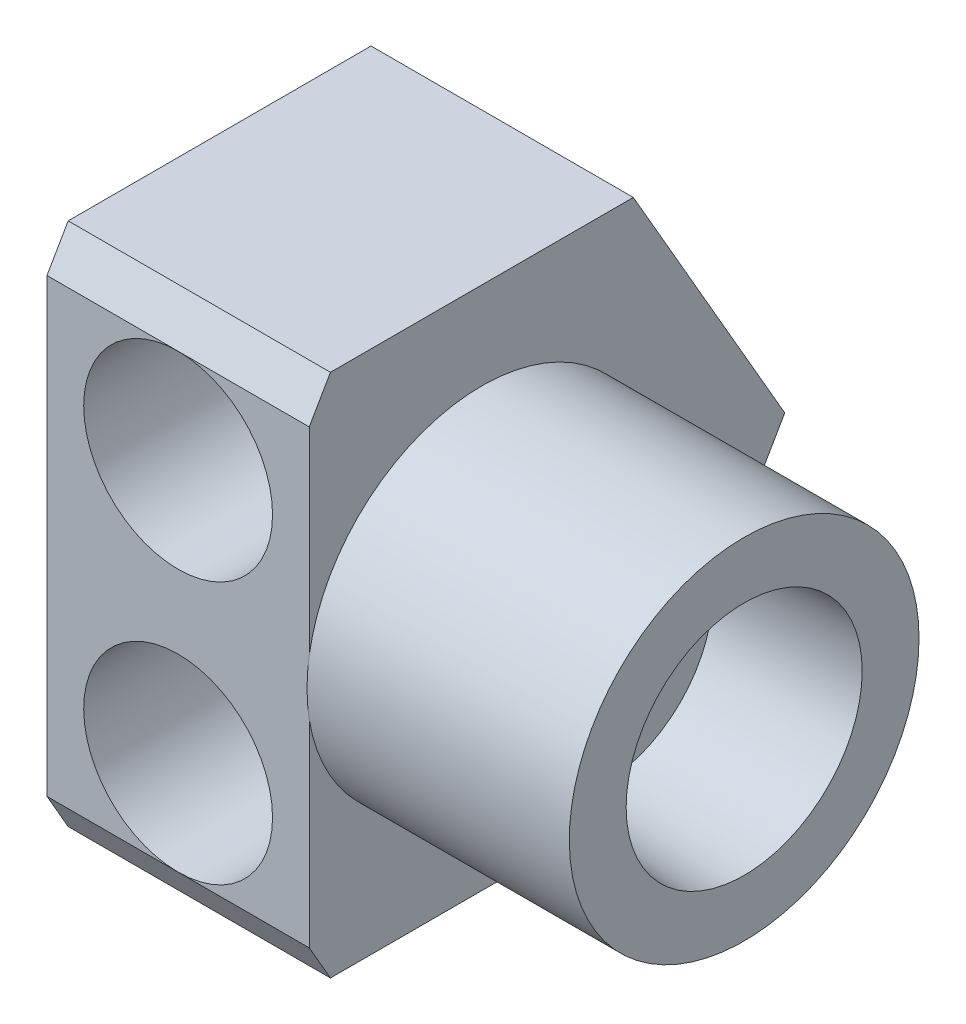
ISO-10303-21;
HEADER;
FILE_DESCRIPTION(('STEP AP214'),'2;1');
FILE_NAME('part.step','',(''),(''),'','','');
FILE_SCHEMA(('AUTOMOTIVE_DESIGN { 1 0 10303 214 1 1 1 1 }'));
ENDSEC;
DATA;
#1=APPLICATION_CONTEXT('core data for automotive mechanical design processes');
#2=APPLICATION_PROTOCOL_DEFINITION('international standard','automotive_design',2000,#1);
#3=PRODUCT_CONTEXT('',#1,'mechanical');
#4=PRODUCT('Part','Part','',(#3));
#5=PRODUCT_RELATED_PRODUCT_CATEGORY('part','',(#4));
#6=PRODUCT_DEFINITION_FORMATION('','',#4);
#7=PRODUCT_DEFINITION_CONTEXT('part definition',#1,'design');
#8=PRODUCT_DEFINITION('design','',#6,#7);
#9=PRODUCT_DEFINITION_SHAPE('','',#8);
#10=(LENGTH_UNIT() NAMED_UNIT(*) SI_UNIT(.MILLI.,.METRE.));
#11=(NAMED_UNIT(*) PLANE_ANGLE_UNIT() SI_UNIT($,.RADIAN.));
#12=(NAMED_UNIT(*) SI_UNIT($,.STERADIAN.) SOLID_ANGLE_UNIT());
#13=UNCERTAINTY_MEASURE_WITH_UNIT(LENGTH_MEASURE(1.E-05),#10,'distance_accuracy_value','');
#14=(GEOMETRIC_REPRESENTATION_CONTEXT(3) GLOBAL_UNCERTAINTY_ASSIGNED_CONTEXT((#13)) GLOBAL_UNIT_ASSIGNED_CONTEXT((#10,
#11,#12)) REPRESENTATION_CONTEXT('',''));
#15=CARTESIAN_POINT('',(0.,0.,0.));
#16=DIRECTION('',(0.,0.,1.));
#17=DIRECTION('',(1.,0.,0.));
#18=AXIS2_PLACEMENT_3D('',#15,#16,#17);
#19=CARTESIAN_POINT('',(9.525,-9.525,-5.01171935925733));
#20=DIRECTION('',(0.,0.,1.));
#21=DIRECTION('',(0.,-1.,0.));
#22=AXIS2_PLACEMENT_3D('',#19,#20,#21);
#23=CONICAL_SURFACE('',#22,5.83094592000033,1.0274700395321);
#24=CARTESIAN_POINT('',(9.525,-9.5250000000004,-8.53337832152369));
#25=VERTEX_POINT('',#24);
#26=VERTEX_LOOP('',#25);
#27=FACE_BOUND('',#26,.T.);
#28=CARTESIAN_POINT('',(9.525,-9.525,-5.01171935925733));
#29=DIRECTION('',(0.,0.,-1.));
#30=DIRECTION('',(0.,1.,0.));
#31=AXIS2_PLACEMENT_3D('',#28,#29,#30);
#32=CIRCLE('',#31,5.83094592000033);
#33=CARTESIAN_POINT('',(9.525,-15.3559459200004,-5.01171935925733));
#34=VERTEX_POINT('',#33);
#35=EDGE_CURVE('E11',#34,#34,#32,.T.);
#36=ORIENTED_EDGE('',*,*,#35,.F.);
#37=EDGE_LOOP('',(#36));
#38=FACE_BOUND('',#37,.T.);
#39=ADVANCED_FACE('F16',(#27,#38),#23,.F.);
#40=CARTESIAN_POINT('',(9.525,9.525,-5.01171935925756));
#41=DIRECTION('',(0.,0.,1.));
#42=DIRECTION('',(0.,-1.,0.));
#43=AXIS2_PLACEMENT_3D('',#40,#41,#42);
#44=CONICAL_SURFACE('',#43,5.83094592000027,1.02747003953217);
#45=CARTESIAN_POINT('',(9.525,9.525,-8.53337832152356));
#46=VERTEX_POINT('',#45);
#47=VERTEX_LOOP('',#46);
#48=FACE_BOUND('',#47,.T.);
#49=CARTESIAN_POINT('',(9.525,9.525,-5.01171935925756));
#50=DIRECTION('',(0.,0.,-1.));
#51=DIRECTION('',(0.,1.,0.));
#52=AXIS2_PLACEMENT_3D('',#49,#50,#51);
#53=CIRCLE('',#52,5.83094592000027);
#54=CARTESIAN_POINT('',(9.525,3.69405407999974,-5.01171935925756));
#55=VERTEX_POINT('',#54);
#56=EDGE_CURVE('E27',#55,#55,#53,.T.);
#57=ORIENTED_EDGE('',*,*,#56,.F.);
#58=EDGE_LOOP('',(#57));
#59=FACE_BOUND('',#58,.T.);
#60=ADVANCED_FACE('F284',(#48,#59),#44,.F.);
#61=CARTESIAN_POINT('',(9.525,-9.525,20.8181197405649));
#62=DIRECTION('',(0.,0.,1.));
#63=DIRECTION('',(0.,1.,0.));
#64=AXIS2_PLACEMENT_3D('',#61,#62,#63);
#65=CYLINDRICAL_SURFACE('',#64,5.83094592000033);
#66=CARTESIAN_POINT('',(7.62798098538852,-4.01126721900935,-2.56732186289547));
#67=CARTESIAN_POINT('',(7.69828168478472,-3.98708001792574,-2.60511273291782));
#68=CARTESIAN_POINT('',(7.77009788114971,-3.96387525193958,-2.64019821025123));
#69=CARTESIAN_POINT('',(7.91668903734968,-3.91972340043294,-2.70531367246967));
#70=CARTESIAN_POINT('',(7.99146402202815,-3.89877591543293,-2.73534333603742));
#71=CARTESIAN_POINT('',(8.10582340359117,-3.86925795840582,-2.77678532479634));
#72=CARTESIAN_POINT('',(8.14430967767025,-3.85973579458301,-2.78999813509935));
#73=CARTESIAN_POINT('',(8.2025890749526,-3.84595446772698,-2.8089324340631));
#74=CARTESIAN_POINT('',(8.22210722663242,-3.84144434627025,-2.81509633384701));
#75=CARTESIAN_POINT('',(8.26132721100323,-3.83259580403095,-2.82713130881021));
#76=CARTESIAN_POINT('',(8.28104366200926,-3.82825426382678,-2.83300658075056));
#77=CARTESIAN_POINT('',(8.37991257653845,-3.80702399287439,-2.8616055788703));
#78=CARTESIAN_POINT('',(8.45959771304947,-3.79163469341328,-2.88191308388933));
#79=CARTESIAN_POINT('',(8.62009959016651,-3.76412202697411,-2.91775633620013));
#80=CARTESIAN_POINT('',(8.7009163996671,-3.75199847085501,-2.93329149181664));
#81=CARTESIAN_POINT('',(8.8636545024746,-3.73109953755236,-2.95982900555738));
#82=CARTESIAN_POINT('',(8.94557581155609,-3.72232398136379,-2.97083112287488));
#83=CARTESIAN_POINT('',(9.11051558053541,-3.7082153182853,-2.98842308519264));
#84=CARTESIAN_POINT('',(9.1935340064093,-3.70288202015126,-2.99501300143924));
#85=CARTESIAN_POINT('',(9.29800071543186,-3.69843677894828,-3.00049556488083));
#86=CARTESIAN_POINT('',(9.31892879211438,-3.69765885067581,-3.00145404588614));
#87=CARTESIAN_POINT('',(9.36085482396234,-3.69632720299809,-3.00309383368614));
#88=CARTESIAN_POINT('',(9.38186951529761,-3.6957732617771,-3.00377541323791));
#89=CARTESIAN_POINT('',(9.44481134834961,-3.69445443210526,-3.0053975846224));
#90=CARTESIAN_POINT('',(9.48668205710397,-3.69403029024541,-3.00591857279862));
#91=CARTESIAN_POINT('',(9.61202671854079,-3.69410474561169,-3.00582707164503));
#92=CARTESIAN_POINT('',(9.69523362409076,-3.69594956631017,-3.0035638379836));
#93=CARTESIAN_POINT('',(9.86094620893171,-3.70314904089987,-2.99468297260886));
#94=CARTESIAN_POINT('',(9.94345186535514,-3.70850382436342,-2.98806521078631));
#95=CARTESIAN_POINT('',(10.107759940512,-3.72266249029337,-2.97040709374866));
#96=CARTESIAN_POINT('',(10.1895623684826,-3.73146648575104,-2.95936692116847));
#97=CARTESIAN_POINT('',(10.3524490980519,-3.75247873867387,-2.93267762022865));
#98=CARTESIAN_POINT('',(10.4335334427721,-3.76468710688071,-2.91702901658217));
#99=CARTESIAN_POINT('',(10.554599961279,-3.78552867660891,-2.88986317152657));
#100=CARTESIAN_POINT('',(10.5949195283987,-3.79291008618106,-2.88017432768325));
#101=CARTESIAN_POINT('',(10.6747292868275,-3.8083834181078,-2.85968299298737));
#102=CARTESIAN_POINT('',(10.7142880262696,-3.81648587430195,-2.84886697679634));
#103=CARTESIAN_POINT('',(10.8319316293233,-3.84184094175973,-2.81468814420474));
#104=CARTESIAN_POINT('',(10.908985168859,-3.86014119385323,-2.78959755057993));
#105=CARTESIAN_POINT('',(11.0603395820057,-3.8992758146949,-2.73462843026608));
#106=CARTESIAN_POINT('',(11.1346403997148,-3.92011055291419,-2.7047500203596));
#107=CARTESIAN_POINT('',(11.2804468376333,-3.96405274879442,-2.63992901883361));
#108=CARTESIAN_POINT('',(11.3519525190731,-3.98716059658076,-2.60498683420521));
#109=CARTESIAN_POINT('',(11.4220190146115,-4.01126721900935,-2.56732186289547));
#110=B_SPLINE_CURVE_WITH_KNOTS('',3,(#66,#67,#68,#69,#70,#71,#72,#73,#74,#75,#76,#77,#78,#79,
#80,#81,#82,#83,#84,#85,#86,#87,#88,#89,#90,#91,#92,#93,#94,#95,#96,#97,#98,#99,#100,#101,#102,
#103,#104,#105,#106,#107,#108,#109),.UNSPECIFIED.,.F.,.F.,(4,2,2,2,2,2,2,2,2,2,2,2,2,2,2,2,2,2,
2,2,2,4),(0.,0.0625,0.125,0.15625,0.171875,0.1875,0.25,0.3125,0.375,0.4375,0.453125,0.46875,0.5,
0.5625,0.625,0.6875,0.75,0.78125,0.8125,0.875,0.9375,1.),.UNSPECIFIED.);
#111=CARTESIAN_POINT('',(7.62798098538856,-4.01126721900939,-2.5673218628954));
#112=VERTEX_POINT('',#111);
#113=CARTESIAN_POINT('',(11.4220190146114,-4.01126721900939,-2.5673218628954));
#114=VERTEX_POINT('',#113);
#115=EDGE_CURVE('E409',#112,#114,#110,.T.);
#116=ORIENTED_EDGE('',*,*,#115,.F.);
#117=CARTESIAN_POINT('',(9.525,-9.525,-2.5673218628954));
#118=DIRECTION('',(0.,0.,-1.));
#119=DIRECTION('',(0.,1.,0.));
#120=AXIS2_PLACEMENT_3D('',#117,#118,#119);
#121=CIRCLE('',#120,5.83094592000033);
#122=EDGE_CURVE('E415',#114,#112,#121,.T.);
#123=ORIENTED_EDGE('',*,*,#122,.F.);
#124=EDGE_LOOP('',(#116,#123));
#125=FACE_BOUND('',#124,.T.);
#126=ORIENTED_EDGE('',*,*,#35,.T.);
#127=EDGE_LOOP('',(#126));
#128=FACE_BOUND('',#127,.T.);
#129=ADVANCED_FACE('F289',(#125,#128),#65,.F.);
#130=CARTESIAN_POINT('',(9.525,9.525,20.8181197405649));
#131=DIRECTION('',(0.,0.,1.));
#132=DIRECTION('',(0.,1.,0.));
#133=AXIS2_PLACEMENT_3D('',#130,#131,#132);
#134=CYLINDRICAL_SURFACE('',#133,5.83094592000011);
#135=CARTESIAN_POINT('',(11.4220190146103,4.01126721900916,-2.56732186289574));
#136=CARTESIAN_POINT('',(11.3517183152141,3.98708001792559,-2.60511273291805));
#137=CARTESIAN_POINT('',(11.2799021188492,3.96387525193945,-2.64019821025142));
#138=CARTESIAN_POINT('',(11.1333109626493,3.91972340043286,-2.70531367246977));
#139=CARTESIAN_POINT('',(11.0585359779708,3.89877591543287,-2.73534333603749));
#140=CARTESIAN_POINT('',(10.9441765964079,3.86925795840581,-2.77678532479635));
#141=CARTESIAN_POINT('',(10.9056903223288,3.85973579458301,-2.78999813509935));
#142=CARTESIAN_POINT('',(10.8474109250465,3.845954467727,-2.80893243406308));
#143=CARTESIAN_POINT('',(10.8278927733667,3.84144434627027,-2.81509633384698));
#144=CARTESIAN_POINT('',(10.7886727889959,3.83259580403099,-2.82713130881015));
#145=CARTESIAN_POINT('',(10.7689563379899,3.82825426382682,-2.83300658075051));
#146=CARTESIAN_POINT('',(10.6700874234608,3.80702399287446,-2.86160557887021));
#147=CARTESIAN_POINT('',(10.5904022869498,3.79163469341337,-2.88191308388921));
#148=CARTESIAN_POINT('',(10.4299004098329,3.76412202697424,-2.91775633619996));
#149=CARTESIAN_POINT('',(10.3490836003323,3.75199847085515,-2.93329149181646));
#150=CARTESIAN_POINT('',(10.1863454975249,3.73109953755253,-2.95982900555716));
#151=CARTESIAN_POINT('',(10.1044241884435,3.72232398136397,-2.97083112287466));
#152=CARTESIAN_POINT('',(9.9394844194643,3.7082153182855,-2.98842308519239));
#153=CARTESIAN_POINT('',(9.85646599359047,3.70288202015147,-2.99501300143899));
#154=CARTESIAN_POINT('',(9.75199928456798,3.6984367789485,-3.00049556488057));
#155=CARTESIAN_POINT('',(9.73107120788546,3.69765885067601,-3.00145404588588));
#156=CARTESIAN_POINT('',(9.68914517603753,3.69632720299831,-3.00309383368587));
#157=CARTESIAN_POINT('',(9.66813048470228,3.69577326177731,-3.00377541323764));
#158=CARTESIAN_POINT('',(9.60518865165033,3.69445443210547,-3.00539758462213));
#159=CARTESIAN_POINT('',(9.56331794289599,3.69403029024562,-3.00591857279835));
#160=CARTESIAN_POINT('',(9.43797328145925,3.6941047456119,-3.00582707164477));
#161=CARTESIAN_POINT('',(9.35476637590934,3.69594956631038,-3.00356383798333));
#162=CARTESIAN_POINT('',(9.1890537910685,3.70314904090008,-2.9946829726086));
#163=CARTESIAN_POINT('',(9.10654813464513,3.70850382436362,-2.98806521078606));
#164=CARTESIAN_POINT('',(8.9422400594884,3.72266249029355,-2.97040709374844));
#165=CARTESIAN_POINT('',(8.86043763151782,3.73146648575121,-2.95936692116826));
#166=CARTESIAN_POINT('',(8.69755090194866,3.75247873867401,-2.93267762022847));
#167=CARTESIAN_POINT('',(8.61646655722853,3.76468710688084,-2.917029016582));
#168=CARTESIAN_POINT('',(8.49540003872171,3.78552867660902,-2.88986317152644));
#169=CARTESIAN_POINT('',(8.45508047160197,3.79291008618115,-2.88017432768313));
#170=CARTESIAN_POINT('',(8.3752707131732,3.80838341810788,-2.85968299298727));
#171=CARTESIAN_POINT('',(8.33571197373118,3.81648587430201,-2.84886697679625));
#172=CARTESIAN_POINT('',(8.21806837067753,3.84184094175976,-2.8146881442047));
#173=CARTESIAN_POINT('',(8.1410148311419,3.86014119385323,-2.78959755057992));
#174=CARTESIAN_POINT('',(7.98966041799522,3.89927581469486,-2.73462843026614));
#175=CARTESIAN_POINT('',(7.91535960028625,3.92011055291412,-2.70475002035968));
#176=CARTESIAN_POINT('',(7.76955316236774,3.96405274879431,-2.63992901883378));
#177=CARTESIAN_POINT('',(7.69804748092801,3.98716059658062,-2.60498683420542));
#178=CARTESIAN_POINT('',(7.62798098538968,4.01126721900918,-2.56732186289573));
#179=B_SPLINE_CURVE_WITH_KNOTS('',3,(#135,#136,#137,#138,#139,#140,#141,#142,#143,#144,#145,
#146,#147,#148,#149,#150,#151,#152,#153,#154,#155,#156,#157,#158,#159,#160,#161,#162,#163,#164,
#165,#166,#167,#168,#169,#170,#171,#172,#173,#174,#175,#176,#177,#178),.UNSPECIFIED.,.F.,.F.,(4,
2,2,2,2,2,2,2,2,2,2,2,2,2,2,2,2,2,2,2,2,4),(0.,0.0625,0.125,0.15625,0.171875,0.1875,0.25,0.3125,
0.375000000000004,0.4375,0.453125,0.46875,0.5,0.5625,0.625,0.6875,0.75,0.78125,0.8125,0.875,
0.9375,1.),.UNSPECIFIED.);
#180=CARTESIAN_POINT('',(11.4220190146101,4.01126721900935,-2.56732186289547));
#181=VERTEX_POINT('',#180);
#182=CARTESIAN_POINT('',(7.62798098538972,4.01126721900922,-2.56732186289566));
#183=VERTEX_POINT('',#182);
#184=EDGE_CURVE('E421',#181,#183,#179,.T.);
#185=ORIENTED_EDGE('',*,*,#184,.F.);
#186=CARTESIAN_POINT('',(9.525,9.525,-2.56732186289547));
#187=DIRECTION('',(0.,0.,-1.));
#188=DIRECTION('',(0.,1.,0.));
#189=AXIS2_PLACEMENT_3D('',#186,#187,#188);
#190=CIRCLE('',#189,5.83094591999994);
#191=EDGE_CURVE('E428',#183,#181,#190,.T.);
#192=ORIENTED_EDGE('',*,*,#191,.F.);
#193=EDGE_LOOP('',(#185,#192));
#194=FACE_BOUND('',#193,.T.);
#195=ORIENTED_EDGE('',*,*,#56,.T.);
#196=EDGE_LOOP('',(#195));
#197=FACE_BOUND('',#196,.T.);
#198=ADVANCED_FACE('F296',(#194,#197),#134,.F.);
#199=CARTESIAN_POINT('',(27.7876,-8.03205001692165,0.));
#200=DIRECTION('',(-1.,0.,0.));
#201=DIRECTION('',(0.,0.,1.));
#202=AXIS2_PLACEMENT_3D('',#199,#200,#201);
#203=PLANE('',#202);
#204=CARTESIAN_POINT('',(27.7876,0.,0.));
#205=DIRECTION('',(-1.,0.,0.));
#206=DIRECTION('',(0.,0.,1.));
#207=AXIS2_PLACEMENT_3D('',#204,#205,#206);
#208=CIRCLE('',#207,8.03205001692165);
#209=CARTESIAN_POINT('',(27.7876,0.,-8.03205001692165));
#210=VERTEX_POINT('',#209);
#211=EDGE_CURVE('E433',#210,#210,#208,.T.);
#212=ORIENTED_EDGE('',*,*,#211,.F.);
#213=EDGE_LOOP('',(#212));
#214=FACE_BOUND('',#213,.T.);
#215=CARTESIAN_POINT('',(27.7876,0.,0.));
#216=DIRECTION('',(-1.,0.,0.));
#217=DIRECTION('',(0.,0.,1.));
#218=AXIS2_PLACEMENT_3D('',#215,#216,#217);
#219=CIRCLE('',#218,4.7625);
#220=CARTESIAN_POINT('',(27.7876,0.,-4.7625));
#221=VERTEX_POINT('',#220);
#222=EDGE_CURVE('E407',#221,#221,#219,.T.);
#223=ORIENTED_EDGE('',*,*,#222,.T.);
#224=EDGE_LOOP('',(#223));
#225=FACE_BOUND('',#224,.T.);
#226=ADVANCED_FACE('F300',(#214,#225),#203,.F.);
#227=CARTESIAN_POINT('',(9.525,-16.383,-2.56732186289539));
#228=DIRECTION('',(0.,0.,1.));
#229=DIRECTION('',(0.,-1.,0.));
#230=AXIS2_PLACEMENT_3D('',#227,#228,#229);
#231=PLANE('',#230);
#232=DIRECTION('',(0.,-1.,0.));
#233=VECTOR('',#232,1.);
#234=CARTESIAN_POINT('',(5.55625,-16.383,-2.56732186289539));
#235=LINE('',#234,#233);
#236=CARTESIAN_POINT('',(5.55625,-3.93204126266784,-2.5673218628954));
#237=VERTEX_POINT('',#236);
#238=CARTESIAN_POINT('',(5.55625,-4.01126721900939,-2.5673218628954));
#239=VERTEX_POINT('',#238);
#240=EDGE_CURVE('E443',#237,#239,#235,.T.);
#241=ORIENTED_EDGE('',*,*,#240,.F.);
#242=CARTESIAN_POINT('',(9.525,-9.525,-2.5673218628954));
#243=DIRECTION('',(0.,0.,-1.));
#244=DIRECTION('',(0.,1.,0.));
#245=AXIS2_PLACEMENT_3D('',#242,#243,#244);
#246=CIRCLE('',#245,6.85800000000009);
#247=CARTESIAN_POINT('',(13.6031018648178,-4.01126721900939,-2.5673218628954));
#248=VERTEX_POINT('',#247);
#249=EDGE_CURVE('E339',#248,#237,#246,.T.);
#250=ORIENTED_EDGE('',*,*,#249,.F.);
#251=DIRECTION('',(-1.,0.,0.));
#252=VECTOR('',#251,1.);
#253=CARTESIAN_POINT('',(57.,-4.01126721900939,-2.5673218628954));
#254=LINE('',#253,#252);
#255=EDGE_CURVE('E413',#114,#248,#254,.F.);
#256=ORIENTED_EDGE('',*,*,#255,.F.);
#257=ORIENTED_EDGE('',*,*,#122,.T.);
#258=DIRECTION('',(-1.,0.,0.));
#259=VECTOR('',#258,1.);
#260=CARTESIAN_POINT('',(57.,-4.01126721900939,-2.5673218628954));
#261=LINE('',#260,#259);
#262=EDGE_CURVE('E412',#239,#112,#261,.F.);
#263=ORIENTED_EDGE('',*,*,#262,.F.);
#264=EDGE_LOOP('',(#241,#250,#256,#257,#263));
#265=FACE_BOUND('',#264,.T.);
#266=ADVANCED_FACE('F304',(#265),#231,.T.);
#267=CARTESIAN_POINT('',(57.,0.,0.));
#268=DIRECTION('',(1.,0.,0.));
#269=DIRECTION('',(0.,0.,1.));
#270=AXIS2_PLACEMENT_3D('',#267,#268,#269);
#271=CYLINDRICAL_SURFACE('',#270,4.7625);
#272=ORIENTED_EDGE('',*,*,#222,.F.);
#273=EDGE_LOOP('',(#272));
#274=FACE_BOUND('',#273,.T.);
#275=CARTESIAN_POINT('',(13.6031018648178,-4.01126721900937,-2.56732186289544));
#276=CARTESIAN_POINT('',(13.6260947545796,-4.02827336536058,-2.54075090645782));
#277=CARTESIAN_POINT('',(13.6486990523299,-4.04521461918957,-2.51370004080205));
#278=CARTESIAN_POINT('',(13.6820204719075,-4.07050284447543,-2.4723821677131));
#279=CARTESIAN_POINT('',(13.6930300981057,-4.07891163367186,-2.45848593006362));
#280=CARTESIAN_POINT('',(13.7148538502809,-4.09568345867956,-2.43044238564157));
#281=CARTESIAN_POINT('',(13.7256781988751,-4.10405448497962,-2.41628127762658));
#282=CARTESIAN_POINT('',(13.7791500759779,-4.14565906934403,-2.34505266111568));
#283=CARTESIAN_POINT('',(13.8198715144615,-4.17815578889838,-2.28669775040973));
#284=CARTESIAN_POINT('',(13.9361359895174,-4.27294852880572,-2.10750604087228));
#285=CARTESIAN_POINT('',(14.0057967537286,-4.33254911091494,-1.98255193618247));
#286=CARTESIAN_POINT('',(14.1304430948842,-4.44277807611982,-1.72139970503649));
#287=CARTESIAN_POINT('',(14.1854330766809,-4.49341375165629,-1.58520694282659));
#288=CARTESIAN_POINT('',(14.2452570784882,-4.54990121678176,-1.40754939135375));
#289=CARTESIAN_POINT('',(14.2567744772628,-4.56085766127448,-1.37164588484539));
#290=CARTESIAN_POINT('',(14.2789133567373,-4.58205485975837,-1.29907979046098));
#291=CARTESIAN_POINT('',(14.2894666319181,-4.5922302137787,-1.2626407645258));
#292=CARTESIAN_POINT('',(14.3196202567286,-4.62147424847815,-1.15287343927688));
#293=CARTESIAN_POINT('',(14.3377182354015,-4.63926291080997,-1.07909017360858));
#294=CARTESIAN_POINT('',(14.3862815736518,-4.68741957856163,-0.855957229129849));
#295=CARTESIAN_POINT('',(14.4110510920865,-4.71258950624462,-0.704831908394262));
#296=CARTESIAN_POINT('',(14.4372895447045,-4.73942459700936,-0.474585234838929));
#297=CARTESIAN_POINT('',(14.4442077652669,-4.74654709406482,-0.39724140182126));
#298=CARTESIAN_POINT('',(14.4518234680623,-4.75440382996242,-0.280314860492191));
#299=CARTESIAN_POINT('',(14.4539011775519,-4.75655134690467,-0.241187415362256));
#300=CARTESIAN_POINT('',(14.4563184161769,-4.75905161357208,-0.182264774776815));
#301=CARTESIAN_POINT('',(14.4570072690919,-4.75976454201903,-0.162584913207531));
#302=CARTESIAN_POINT('',(14.4581466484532,-4.76094407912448,-0.123303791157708));
#303=CARTESIAN_POINT('',(14.4585980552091,-4.76141159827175,-0.10368301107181));
#304=CARTESIAN_POINT('',(14.4602687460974,-4.76314215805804,-0.0056772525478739));
#305=CARTESIAN_POINT('',(14.4597322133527,-4.76258531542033,0.0724136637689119));
#306=CARTESIAN_POINT('',(14.4549902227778,-4.75767663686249,0.227981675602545));
#307=CARTESIAN_POINT('',(14.4507845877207,-4.75332467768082,0.305458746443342));
#308=CARTESIAN_POINT('',(14.4387025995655,-4.74088399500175,0.459803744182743));
#309=CARTESIAN_POINT('',(14.4308262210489,-4.7327951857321,0.536671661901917));
#310=CARTESIAN_POINT('',(14.4113255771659,-4.71291310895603,0.68979473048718));
#311=CARTESIAN_POINT('',(14.3997014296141,-4.70111978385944,0.766049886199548));
#312=CARTESIAN_POINT('',(14.3793388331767,-4.68065782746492,0.879964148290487));
#313=CARTESIAN_POINT('',(14.3720629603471,-4.67337499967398,0.91785742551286));
#314=CARTESIAN_POINT('',(14.3603964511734,-4.66175671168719,0.974578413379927));
#315=CARTESIAN_POINT('',(14.3563882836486,-4.65777441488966,0.993434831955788));
#316=CARTESIAN_POINT('',(14.3481482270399,-4.64960885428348,1.03097660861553));
#317=CARTESIAN_POINT('',(14.3439140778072,-4.64542333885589,1.0496730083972));
#318=CARTESIAN_POINT('',(14.3221729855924,-4.62399073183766,1.14278550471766));
#319=CARTESIAN_POINT('',(14.302957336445,-4.60522947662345,1.21609422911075));
#320=CARTESIAN_POINT('',(14.2397943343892,-4.54440810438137,1.43256101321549));
#321=CARTESIAN_POINT('',(14.1903561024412,-4.49781526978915,1.57227026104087));
#322=CARTESIAN_POINT('',(14.1045213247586,-4.41993967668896,1.77504420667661));
#323=CARTESIAN_POINT('',(14.0739570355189,-4.39264850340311,1.84150104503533));
#324=CARTESIAN_POINT('',(14.0331923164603,-4.35697490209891,1.92314676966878));
#325=CARTESIAN_POINT('',(14.0249112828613,-4.34976219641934,1.93940460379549));
#326=CARTESIAN_POINT('',(14.0080895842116,-4.33518346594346,1.97177729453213));
#327=CARTESIAN_POINT('',(13.9995440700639,-4.32781328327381,1.98790109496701));
#328=CARTESIAN_POINT('',(13.9735450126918,-4.30550453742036,2.03599760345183));
#329=CARTESIAN_POINT('',(13.9557824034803,-4.29041347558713,2.06759823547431));
#330=CARTESIAN_POINT('',(13.8648194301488,-4.21395792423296,2.22333734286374));
#331=CARTESIAN_POINT('',(13.7851847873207,-4.14960129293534,2.34070079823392));
#332=CARTESIAN_POINT('',(13.6119051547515,-4.01670698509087,2.56205700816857));
#333=CARTESIAN_POINT('',(13.5182570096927,-3.94816397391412,2.66604415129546));
#334=CARTESIAN_POINT('',(13.4046726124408,-3.86986610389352,2.775926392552));
#335=CARTESIAN_POINT('',(13.3919376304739,-3.86114983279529,2.78803671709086));
#336=CARTESIAN_POINT('',(13.3662371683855,-3.84368832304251,2.81206095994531));
#337=CARTESIAN_POINT('',(13.3532630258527,-3.83493729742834,2.82398266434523));
#338=CARTESIAN_POINT('',(13.3140556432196,-3.8086890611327,2.85939810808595));
#339=CARTESIAN_POINT('',(13.2875771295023,-3.79122290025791,2.88250768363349));
#340=CARTESIAN_POINT('',(13.2071300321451,-3.73896747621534,2.95038810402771));
#341=CARTESIAN_POINT('',(13.1521502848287,-3.70432179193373,2.99371170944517));
#342=CARTESIAN_POINT('',(12.9832243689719,-3.6012977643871,3.11828071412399));
#343=CARTESIAN_POINT('',(12.8652967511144,-3.53383756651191,3.1941369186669));
#344=CARTESIAN_POINT('',(12.6805687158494,-3.43571338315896,3.29841748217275));
#345=CARTESIAN_POINT('',(12.6176852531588,-3.40351487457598,3.33159032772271));
#346=CARTESIAN_POINT('',(12.521403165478,-3.35612557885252,3.3791016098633));
#347=CARTESIAN_POINT('',(12.4889829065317,-3.34048050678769,3.39456386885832));
#348=CARTESIAN_POINT('',(12.4234896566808,-3.30951661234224,3.42475892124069));
#349=CARTESIAN_POINT('',(12.3903978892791,-3.29419008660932,3.4394985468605));
#350=CARTESIAN_POINT('',(12.2241251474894,-3.21879517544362,3.51107977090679));
#351=CARTESIAN_POINT('',(12.087898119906,-3.1621484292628,3.56188832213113));
#352=CARTESIAN_POINT('',(11.8093670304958,-3.05692500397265,3.65259368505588));
#353=CARTESIAN_POINT('',(11.667062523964,-3.00834569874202,3.69248592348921));
#354=CARTESIAN_POINT('',(11.4491908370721,-2.94203589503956,3.74521408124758));
#355=CARTESIAN_POINT('',(11.37583000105,-2.92102566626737,3.76160116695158));
#356=CARTESIAN_POINT('',(11.26469110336,-2.89121450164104,3.78450022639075));
#357=CARTESIAN_POINT('',(11.2274617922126,-2.88156149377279,3.7918527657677));
#358=CARTESIAN_POINT('',(11.1526375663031,-2.86283463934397,3.80601128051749));
#359=CARTESIAN_POINT('',(11.1150243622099,-2.85375726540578,3.81281978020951));
#360=CARTESIAN_POINT('',(10.9268362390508,-2.81002355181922,3.84539688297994));
#361=CARTESIAN_POINT('',(10.7752999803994,-2.78016689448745,3.86691056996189));
#362=CARTESIAN_POINT('',(10.4703524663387,-2.73071325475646,3.90199057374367));
#363=CARTESIAN_POINT('',(10.3169410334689,-2.71111574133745,3.91555403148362));
#364=CARTESIAN_POINT('',(10.0082819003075,-2.68229381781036,3.93535408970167));
#365=CARTESIAN_POINT('',(9.85303423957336,-2.67306865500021,3.94159010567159));
#366=CARTESIAN_POINT('',(9.65781684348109,-2.66817500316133,3.94490174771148));
#367=CARTESIAN_POINT('',(9.61871533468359,-2.66752852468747,3.94533876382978));
#368=CARTESIAN_POINT('',(9.55997541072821,-2.66706123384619,3.94565465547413));
#369=CARTESIAN_POINT('',(9.54038082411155,-2.66698921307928,3.94570333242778));
#370=CARTESIAN_POINT('',(9.50116230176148,-2.66701339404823,3.9456869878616));
#371=CARTESIAN_POINT('',(9.48153634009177,-2.66710972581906,3.94562187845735));
#372=CARTESIAN_POINT('',(9.38354782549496,-2.66801079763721,3.94501272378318));
#373=CARTESIAN_POINT('',(9.30543815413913,-2.67007286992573,3.94361937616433));
#374=CARTESIAN_POINT('',(9.07193966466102,-2.68020798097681,3.93674460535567));
#375=CARTESIAN_POINT('',(8.91737931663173,-2.6922256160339,3.9285826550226));
#376=CARTESIAN_POINT('',(8.61045257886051,-2.7264993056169,3.90487413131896));
#377=CARTESIAN_POINT('',(8.45808624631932,-2.74875625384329,3.88932822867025));
#378=CARTESIAN_POINT('',(8.15559642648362,-2.80335450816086,3.85016084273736));
#379=CARTESIAN_POINT('',(8.00547274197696,-2.83569652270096,3.82654226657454));
#380=CARTESIAN_POINT('',(7.81929233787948,-2.88239515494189,3.79121900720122));
#381=CARTESIAN_POINT('',(7.78213014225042,-2.89204866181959,3.78386294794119));
#382=CARTESIAN_POINT('',(7.72649958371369,-2.90699962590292,3.77237311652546));
#383=CARTESIAN_POINT('',(7.70797485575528,-2.91206173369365,3.76846719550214));
#384=CARTESIAN_POINT('',(7.67096333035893,-2.92234288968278,3.76050004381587));
#385=CARTESIAN_POINT('',(7.65246604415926,-2.92756500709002,3.75643640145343));
#386=CARTESIAN_POINT('',(7.56028001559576,-2.95400876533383,3.73576757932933));
#387=CARTESIAN_POINT('',(7.48739401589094,-2.97625545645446,3.7180920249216));
#388=CARTESIAN_POINT('',(7.2713294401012,-3.04610734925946,3.66145198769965));
#389=CARTESIAN_POINT('',(7.1307395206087,-3.09682526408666,3.61888800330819));
#390=CARTESIAN_POINT('',(6.85661159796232,-3.20569489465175,3.52281099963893));
#391=CARTESIAN_POINT('',(6.72307346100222,-3.26384938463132,3.46930137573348));
#392=CARTESIAN_POINT('',(6.52828048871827,-3.35596482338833,3.37945942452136));
#393=CARTESIAN_POINT('',(6.46426974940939,-3.38748319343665,3.34791177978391));
#394=CARTESIAN_POINT('',(6.36967392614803,-3.43588381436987,3.29797604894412));
#395=CARTESIAN_POINT('',(6.33837878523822,-3.45220444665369,3.28089476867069));
#396=CARTESIAN_POINT('',(6.29179708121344,-3.47695303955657,3.25458887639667));
#397=CARTESIAN_POINT('',(6.27632105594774,-3.48525208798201,3.24570085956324));
#398=CARTESIAN_POINT('',(6.24556603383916,-3.50189593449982,3.227736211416));
#399=CARTESIAN_POINT('',(6.2302805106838,-3.51024410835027,3.21865607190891));
#400=CARTESIAN_POINT('',(6.09353760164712,-3.58559846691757,3.13604350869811));
#401=CARTESIAN_POINT('',(5.97786056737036,-3.65415531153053,3.05628537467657));
#402=CARTESIAN_POINT('',(5.75822562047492,-3.79259855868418,2.88269448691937));
#403=CARTESIAN_POINT('',(5.65426621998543,-3.86248918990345,2.7888670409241));
#404=CARTESIAN_POINT('',(5.55625,-3.93204126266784,2.68709094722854));
#405=B_SPLINE_CURVE_WITH_KNOTS('',3,(#275,#276,#277,#278,#279,#280,#281,#282,#283,#284,#285,
#286,#287,#288,#289,#290,#291,#292,#293,#294,#295,#296,#297,#298,#299,#300,#301,#302,#303,#304,
#305,#306,#307,#308,#309,#310,#311,#312,#313,#314,#315,#316,#317,#318,#319,#320,#321,#322,#323,
#324,#325,#326,#327,#328,#329,#330,#331,#332,#333,#334,#335,#336,#337,#338,#339,#340,#341,#342,
#343,#344,#345,#346,#347,#348,#349,#350,#351,#352,#353,#354,#355,#356,#357,#358,#359,#360,#361,
#362,#363,#364,#365,#366,#367,#368,#369,#370,#371,#372,#373,#374,#375,#376,#377,#378,#379,#380,
#381,#382,#383,#384,#385,#386,#387,#388,#389,#390,#391,#392,#393,#394,#395,#396,#397,#398,#399,
#400,#401,#402,#403,#404),.UNSPECIFIED.,.F.,.F.,(4,2,2,2,2,2,2,2,2,2,2,2,2,2,2,2,2,2,2,2,2,2,2,
2,2,2,2,2,2,2,2,2,2,2,2,2,2,2,2,2,2,2,2,2,2,2,2,2,2,2,2,2,2,2,2,2,2,2,2,2,2,2,2,2,4),(0.,
0.00781250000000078,0.011718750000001,0.0156250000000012,0.0312500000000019,0.062500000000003,
0.0937500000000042,0.101562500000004,0.109375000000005,0.125000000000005,0.156250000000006,
0.171875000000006,0.179687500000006,0.183593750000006,0.187500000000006,0.203125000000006,
0.218750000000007,0.234375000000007,0.250000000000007,0.257812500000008,0.261718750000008,
0.265625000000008,0.281250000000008,0.31250000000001,0.32812500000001,0.332031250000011,
0.335937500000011,0.343750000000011,0.375000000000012,0.406250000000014,0.410156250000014,
0.414062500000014,0.421875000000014,0.437500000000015,0.468750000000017,0.484375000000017,
0.492187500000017,0.500000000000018,0.531250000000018,0.562500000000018,0.578125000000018,
0.585937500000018,0.593750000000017,0.625000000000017,0.656250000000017,0.687500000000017,
0.695312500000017,0.699218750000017,0.703125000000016,0.718750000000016,0.750000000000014,
0.781250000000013,0.812500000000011,0.820312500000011,0.82421875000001,0.82812500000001,
0.843750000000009,0.875,0.90625,0.921875,0.9296875,0.933593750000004,0.9375,0.96875,1.),.UNSPECIFIED.);
#406=CARTESIAN_POINT('',(5.55625,-3.93204126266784,2.68709094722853));
#407=VERTEX_POINT('',#406);
#408=EDGE_CURVE('E419',#248,#407,#405,.T.);
#409=ORIENTED_EDGE('',*,*,#408,.T.);
#410=CARTESIAN_POINT('',(5.55625,0.,0.));
#411=DIRECTION('',(-1.,0.,0.));
#412=DIRECTION('',(0.,0.,1.));
#413=AXIS2_PLACEMENT_3D('',#410,#411,#412);
#414=CIRCLE('',#413,4.7625);
#415=CARTESIAN_POINT('',(5.55625,3.93204126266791,2.68709094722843));
#416=VERTEX_POINT('',#415);
#417=EDGE_CURVE('E463',#407,#416,#414,.T.);
#418=ORIENTED_EDGE('',*,*,#417,.T.);
#419=CARTESIAN_POINT('',(5.55625,3.93204126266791,2.68709094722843));
#420=CARTESIAN_POINT('',(5.65433964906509,3.86243708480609,2.78894328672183));
#421=CARTESIAN_POINT('',(5.7580311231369,3.79274478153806,2.88247735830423));
#422=CARTESIAN_POINT('',(5.976264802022,3.65513774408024,3.05508703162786));
#423=CARTESIAN_POINT('',(6.09080900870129,3.58721832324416,3.13415570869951));
#424=CARTESIAN_POINT('',(6.33059803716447,3.45485048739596,3.27949316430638));
#425=CARTESIAN_POINT('',(6.45584312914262,3.39039872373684,3.34575870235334));
#426=CARTESIAN_POINT('',(6.60277008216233,3.32072222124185,3.41384348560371));
#427=CARTESIAN_POINT('',(6.61917910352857,3.3130196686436,3.42131848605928));
#428=CARTESIAN_POINT('',(6.65216496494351,3.2976961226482,3.4360907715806));
#429=CARTESIAN_POINT('',(6.66875351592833,3.29006983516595,3.44339307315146));
#430=CARTESIAN_POINT('',(6.71867014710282,3.26736360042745,3.46499319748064));
#431=CARTESIAN_POINT('',(6.75214266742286,3.25245868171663,3.47898243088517));
#432=CARTESIAN_POINT('',(6.85313471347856,3.20845874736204,3.51977252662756));
#433=CARTESIAN_POINT('',(6.92122841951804,3.18007872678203,3.54539706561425));
#434=CARTESIAN_POINT('',(7.12773955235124,3.09792757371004,3.61795387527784));
#435=CARTESIAN_POINT('',(7.26838258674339,3.04714612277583,3.66058580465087));
#436=CARTESIAN_POINT('',(7.55536117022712,2.95419823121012,3.73600063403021));
#437=CARTESIAN_POINT('',(7.7016967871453,2.91202952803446,3.76878060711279));
#438=CARTESIAN_POINT('',(7.88810911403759,2.86510283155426,3.80430421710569));
#439=CARTESIAN_POINT('',(7.92556656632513,2.85600679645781,3.81113526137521));
#440=CARTESIAN_POINT('',(8.00083122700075,2.83840391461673,3.82426333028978));
#441=CARTESIAN_POINT('',(8.03867585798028,2.8298893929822,3.83056594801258));
#442=CARTESIAN_POINT('',(8.15230090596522,2.80533727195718,3.848623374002));
#443=CARTESIAN_POINT('',(8.22825629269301,2.79026844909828,3.85954604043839));
#444=CARTESIAN_POINT('',(8.4567212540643,2.74894644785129,3.88919648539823));
#445=CARTESIAN_POINT('',(8.60982815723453,2.72657386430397,3.90482240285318));
#446=CARTESIAN_POINT('',(8.91758132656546,2.69219823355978,3.92860174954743));
#447=CARTESIAN_POINT('',(9.07222765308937,2.68019469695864,3.93675361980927));
#448=CARTESIAN_POINT('',(9.30534589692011,2.67007726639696,3.94361639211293));
#449=CARTESIAN_POINT('',(9.38324379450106,2.66802049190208,3.94500616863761));
#450=CARTESIAN_POINT('',(9.53942664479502,2.66657053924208,3.94598638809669));
#451=CARTESIAN_POINT('',(9.61773451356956,2.66717791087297,3.94557648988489));
#452=CARTESIAN_POINT('',(9.85310851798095,2.6730552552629,3.94159919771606));
#453=CARTESIAN_POINT('',(10.0087276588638,2.68232480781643,3.93533303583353));
#454=CARTESIAN_POINT('',(10.3174294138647,2.71117201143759,3.91551513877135));
#455=CARTESIAN_POINT('',(10.4705117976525,2.73075086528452,3.90196310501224));
#456=CARTESIAN_POINT('',(10.7741193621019,2.77996370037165,3.86705549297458));
#457=CARTESIAN_POINT('',(10.9246446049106,2.80959861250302,3.8457017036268));
#458=CARTESIAN_POINT('',(11.2230428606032,2.87877767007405,3.7941936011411));
#459=CARTESIAN_POINT('',(11.3709162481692,2.91832270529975,3.76404364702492));
#460=CARTESIAN_POINT('',(11.5356830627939,2.96834813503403,3.7242940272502));
#461=CARTESIAN_POINT('',(11.5539624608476,2.97398180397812,3.71979727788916));
#462=CARTESIAN_POINT('',(11.5903839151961,2.98537330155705,3.71066110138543));
#463=CARTESIAN_POINT('',(11.608537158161,2.99113450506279,3.70601899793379));
#464=CARTESIAN_POINT('',(11.662824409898,3.00861170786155,3.6918676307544));
#465=CARTESIAN_POINT('',(11.6987859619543,3.02052129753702,3.68213335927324));
#466=CARTESIAN_POINT('',(11.8059798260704,3.05700236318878,3.65200461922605));
#467=CARTESIAN_POINT('',(11.8765216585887,3.08232616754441,3.63068503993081));
#468=CARTESIAN_POINT('',(12.0853658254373,3.1611304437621,3.5627895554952));
#469=CARTESIAN_POINT('',(12.2208916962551,3.21744633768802,3.51229179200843));
#470=CARTESIAN_POINT('',(12.4843159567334,3.33666304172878,3.39924025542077));
#471=CARTESIAN_POINT('',(12.6122148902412,3.39956710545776,3.33669130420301));
#472=CARTESIAN_POINT('',(12.767082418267,3.48163220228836,3.24964858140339));
#473=CARTESIAN_POINT('',(12.797805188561,3.4982165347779,3.23179567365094));
#474=CARTESIAN_POINT('',(12.8435073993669,3.52333566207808,3.20431990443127));
#475=CARTESIAN_POINT('',(12.8586890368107,3.53175544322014,3.19503818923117));
#476=CARTESIAN_POINT('',(12.8888644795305,3.54864001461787,3.17627448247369));
#477=CARTESIAN_POINT('',(12.9038527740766,3.55710158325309,3.16679619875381));
#478=CARTESIAN_POINT('',(12.9782986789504,3.59949668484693,3.11891764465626));
#479=CARTESIAN_POINT('',(13.0362700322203,3.63369213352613,3.07905656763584));
#480=CARTESIAN_POINT('',(13.2054773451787,3.73676218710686,2.9545932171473));
#481=CARTESIAN_POINT('',(13.3120126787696,3.8061251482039,2.86512104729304));
#482=CARTESIAN_POINT('',(13.5126669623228,3.94418403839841,2.67187565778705));
#483=CARTESIAN_POINT('',(13.6067883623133,4.01288469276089,2.56810863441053));
#484=CARTESIAN_POINT('',(13.7166177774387,4.09699209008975,2.42839983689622));
#485=CARTESIAN_POINT('',(13.73821636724,4.11374432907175,2.39991981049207));
#486=CARTESIAN_POINT('',(13.7803168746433,4.14678855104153,2.3423603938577));
#487=CARTESIAN_POINT('',(13.8008557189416,4.16310828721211,2.31323655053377));
#488=CARTESIAN_POINT('',(13.8609721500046,4.21141806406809,2.22483144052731));
#489=CARTESIAN_POINT('',(13.8990506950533,4.24275863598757,2.16451710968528));
#490=CARTESIAN_POINT('',(14.0075242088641,4.33384810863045,1.97941467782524));
#491=CARTESIAN_POINT('',(14.0721757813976,4.39066888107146,1.85047831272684));
#492=CARTESIAN_POINT('',(14.1582787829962,4.46867805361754,1.64849384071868));
#493=CARTESIAN_POINT('',(14.1851628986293,4.49347675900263,1.5797331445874));
#494=CARTESIAN_POINT('',(14.2227960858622,4.52868425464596,1.47437992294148));
#495=CARTESIAN_POINT('',(14.2348913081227,4.54008819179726,1.43889325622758));
#496=CARTESIAN_POINT('',(14.2523610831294,4.55667174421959,1.38509961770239));
#497=CARTESIAN_POINT('',(14.2580721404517,4.56211252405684,1.3670744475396));
#498=CARTESIAN_POINT('',(14.2692696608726,4.57281569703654,1.33083426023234));
#499=CARTESIAN_POINT('',(14.2747527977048,4.57807494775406,1.3126289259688));
#500=CARTESIAN_POINT('',(14.3228977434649,4.62440122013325,1.14859687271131));
#501=CARTESIAN_POINT('',(14.3575406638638,4.65876941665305,1.00035142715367));
#502=CARTESIAN_POINT('',(14.4119278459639,4.71339054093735,0.699131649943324));
#503=CARTESIAN_POINT('',(14.4316719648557,4.73364817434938,0.546158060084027));
#504=CARTESIAN_POINT('',(14.4472059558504,4.74963902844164,0.351929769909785));
#505=CARTESIAN_POINT('',(14.449852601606,4.75236962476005,0.312932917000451));
#506=CARTESIAN_POINT('',(14.4531266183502,4.7557511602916,0.254207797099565));
#507=CARTESIAN_POINT('',(14.4541019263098,4.75675926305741,0.234594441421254));
#508=CARTESIAN_POINT('',(14.4558190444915,4.75853494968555,0.195290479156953));
#509=CARTESIAN_POINT('',(14.4565612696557,4.75930296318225,0.175582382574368));
#510=CARTESIAN_POINT('',(14.4596746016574,4.76252549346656,0.0771950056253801));
#511=CARTESIAN_POINT('',(14.4602666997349,4.76314008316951,-0.00119729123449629));
#512=CARTESIAN_POINT('',(14.4577567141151,4.76054006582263,-0.157363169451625));
#513=CARTESIAN_POINT('',(14.4546544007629,4.75732532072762,-0.235136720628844));
#514=CARTESIAN_POINT('',(14.4447770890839,4.74713355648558,-0.390072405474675));
#515=CARTESIAN_POINT('',(14.4380020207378,4.74015644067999,-0.467234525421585));
#516=CARTESIAN_POINT('',(14.4207244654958,4.72247996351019,-0.620946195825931));
#517=CARTESIAN_POINT('',(14.4102220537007,4.71178053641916,-0.697495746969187));
#518=CARTESIAN_POINT('',(14.3915745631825,4.69295136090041,-0.811853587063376));
#519=CARTESIAN_POINT('',(14.3848758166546,4.6862114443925,-0.849895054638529));
#520=CARTESIAN_POINT('',(14.3740853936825,4.67540612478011,-0.906839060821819));
#521=CARTESIAN_POINT('',(14.3703648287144,4.6716884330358,-0.925800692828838));
#522=CARTESIAN_POINT('',(14.362672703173,4.66402105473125,-0.963684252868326));
#523=CARTESIAN_POINT('',(14.3587012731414,4.66007152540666,-0.982603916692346));
#524=CARTESIAN_POINT('',(14.32196120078,4.62362844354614,-1.1520413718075));
#525=CARTESIAN_POINT('',(14.282016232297,4.58463426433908,-1.29788276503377));
#526=CARTESIAN_POINT('',(14.1872048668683,4.49506333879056,-1.58043556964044));
#527=CARTESIAN_POINT('',(14.132334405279,4.44447880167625,-1.7171429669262));
#528=CARTESIAN_POINT('',(14.05366281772,4.37487199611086,-1.88233541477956));
#529=CARTESIAN_POINT('',(14.0374223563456,4.36063159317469,-1.91508853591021));
#530=CARTESIAN_POINT('',(14.0039024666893,4.33153398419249,-1.98002154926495));
#531=CARTESIAN_POINT('',(13.9865953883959,4.31665364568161,-2.01224778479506));
#532=CARTESIAN_POINT('',(13.9334408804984,4.27143191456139,-2.10741785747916));
#533=CARTESIAN_POINT('',(13.8962812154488,4.24043933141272,-2.16902431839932));
#534=CARTESIAN_POINT('',(13.779609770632,4.14535991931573,-2.34856152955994));
#535=CARTESIAN_POINT('',(13.694915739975,4.07917517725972,-2.46122025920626));
#536=CARTESIAN_POINT('',(13.6031018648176,4.01126721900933,-2.56732186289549));
#537=B_SPLINE_CURVE_WITH_KNOTS('',3,(#419,#420,#421,#422,#423,#424,#425,#426,#427,#428,#429,
#430,#431,#432,#433,#434,#435,#436,#437,#438,#439,#440,#441,#442,#443,#444,#445,#446,#447,#448,
#449,#450,#451,#452,#453,#454,#455,#456,#457,#458,#459,#460,#461,#462,#463,#464,#465,#466,#467,
#468,#469,#470,#471,#472,#473,#474,#475,#476,#477,#478,#479,#480,#481,#482,#483,#484,#485,#486,
#487,#488,#489,#490,#491,#492,#493,#494,#495,#496,#497,#498,#499,#500,#501,#502,#503,#504,#505,
#506,#507,#508,#509,#510,#511,#512,#513,#514,#515,#516,#517,#518,#519,#520,#521,#522,#523,#524,
#525,#526,#527,#528,#529,#530,#531,#532,#533,#534,#535,#536),.UNSPECIFIED.,.F.,.F.,(4,2,2,2,2,2,
2,2,2,2,2,2,2,2,2,2,2,2,2,2,2,2,2,2,2,2,2,2,2,2,2,2,2,2,2,2,2,2,2,2,2,2,2,2,2,2,2,2,2,2,2,2,2,2,
2,2,2,2,4),(0.,0.0312500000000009,0.0625000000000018,0.0937500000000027,0.0976562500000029,
0.101562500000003,0.109375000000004,0.125000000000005,0.156250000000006,0.187500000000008,
0.195312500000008,0.203125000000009,0.218750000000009,0.25000000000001,0.281250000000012,
0.296875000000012,0.312500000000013,0.343750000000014,0.375000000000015,0.406250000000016,
0.437500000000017,0.441406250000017,0.445312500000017,0.453125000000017,0.468750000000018,
0.500000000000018,0.531250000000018,0.539062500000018,0.542968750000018,0.546875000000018,
0.562500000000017,0.593750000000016,0.625000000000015,0.632812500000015,0.640625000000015,
0.656250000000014,0.687500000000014,0.703125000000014,0.710937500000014,0.714843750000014,
0.718750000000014,0.750000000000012,0.781250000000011,0.78906250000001,0.79296875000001,
0.79687500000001,0.812500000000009,0.828125,0.84375,0.859375,0.8671875,0.871093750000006,0.875,
0.90625,0.9375,0.9453125,0.953125,0.96875,1.),.UNSPECIFIED.);
#538=CARTESIAN_POINT('',(13.6031018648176,4.01126721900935,-2.56732186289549));
#539=VERTEX_POINT('',#538);
#540=EDGE_CURVE('E468',#416,#539,#537,.T.);
#541=ORIENTED_EDGE('',*,*,#540,.T.);
#542=DIRECTION('',(-1.,0.,0.));
#543=VECTOR('',#542,1.);
#544=CARTESIAN_POINT('',(57.,4.01126721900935,-2.56732186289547));
#545=LINE('',#544,#543);
#546=EDGE_CURVE('E425',#539,#181,#545,.T.);
#547=ORIENTED_EDGE('',*,*,#546,.T.);
#548=ORIENTED_EDGE('',*,*,#184,.T.);
#549=DIRECTION('',(-1.,0.,0.));
#550=VECTOR('',#549,1.);
#551=CARTESIAN_POINT('',(57.,4.01126721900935,-2.56732186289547));
#552=LINE('',#551,#550);
#553=CARTESIAN_POINT('',(5.55625,4.01126721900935,-2.56732186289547));
#554=VERTEX_POINT('',#553);
#555=EDGE_CURVE('E426',#183,#554,#552,.T.);
#556=ORIENTED_EDGE('',*,*,#555,.T.);
#557=CARTESIAN_POINT('',(5.55625,0.,0.));
#558=DIRECTION('',(-1.,0.,0.));
#559=DIRECTION('',(0.,0.,1.));
#560=AXIS2_PLACEMENT_3D('',#557,#558,#559);
#561=CIRCLE('',#560,4.7625);
#562=EDGE_CURVE('E458',#554,#239,#561,.T.);
#563=ORIENTED_EDGE('',*,*,#562,.T.);
#564=ORIENTED_EDGE('',*,*,#262,.T.);
#565=ORIENTED_EDGE('',*,*,#115,.T.);
#566=ORIENTED_EDGE('',*,*,#255,.T.);
#567=EDGE_LOOP('',(#409,#418,#541,#547,#548,#556,#563,#564,#565,#566));
#568=FACE_BOUND('',#567,.T.);
#569=ADVANCED_FACE('F308',(#274,#568),#271,.F.);
#570=CARTESIAN_POINT('',(9.525,15.35594592,-2.56732186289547));
#571=DIRECTION('',(0.,0.,1.));
#572=DIRECTION('',(0.,-1.,0.));
#573=AXIS2_PLACEMENT_3D('',#570,#571,#572);
#574=PLANE('',#573);
#575=ORIENTED_EDGE('',*,*,#546,.F.);
#576=CARTESIAN_POINT('',(9.525,9.525,-2.56732186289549));
#577=DIRECTION('',(0.,0.,-1.));
#578=DIRECTION('',(0.,1.,0.));
#579=AXIS2_PLACEMENT_3D('',#576,#577,#578);
#580=CIRCLE('',#579,6.858);
#581=CARTESIAN_POINT('',(5.55625,3.93204126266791,-2.56732186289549));
#582=VERTEX_POINT('',#581);
#583=EDGE_CURVE('E340',#582,#539,#580,.T.);
#584=ORIENTED_EDGE('',*,*,#583,.F.);
#585=DIRECTION('',(0.,-1.,0.));
#586=VECTOR('',#585,1.);
#587=CARTESIAN_POINT('',(5.55625,15.35594592,-2.56732186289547));
#588=LINE('',#587,#586);
#589=EDGE_CURVE('E446',#554,#582,#588,.T.);
#590=ORIENTED_EDGE('',*,*,#589,.F.);
#591=ORIENTED_EDGE('',*,*,#555,.F.);
#592=ORIENTED_EDGE('',*,*,#191,.T.);
#593=EDGE_LOOP('',(#575,#584,#590,#591,#592));
#594=FACE_BOUND('',#593,.T.);
#595=ADVANCED_FACE('F312',(#594),#574,.T.);
#596=CARTESIAN_POINT('',(5.55625,-4.7625,0.));
#597=DIRECTION('',(-1.,0.,0.));
#598=DIRECTION('',(0.,0.,1.));
#599=AXIS2_PLACEMENT_3D('',#596,#597,#598);
#600=PLANE('',#599);
#601=DIRECTION('',(0.,0.,-1.));
#602=VECTOR('',#601,1.);
#603=CARTESIAN_POINT('',(5.55625,-3.93204126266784,20.8181197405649));
#604=LINE('',#603,#602);
#605=EDGE_CURVE('E431',#407,#237,#604,.T.);
#606=ORIENTED_EDGE('',*,*,#605,.T.);
#607=ORIENTED_EDGE('',*,*,#240,.T.);
#608=ORIENTED_EDGE('',*,*,#562,.F.);
#609=ORIENTED_EDGE('',*,*,#589,.T.);
#610=DIRECTION('',(0.,0.,-1.));
#611=VECTOR('',#610,1.);
#612=CARTESIAN_POINT('',(5.55625,3.93204126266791,20.8181197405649));
#613=LINE('',#612,#611);
#614=EDGE_CURVE('E437',#582,#416,#613,.F.);
#615=ORIENTED_EDGE('',*,*,#614,.T.);
#616=ORIENTED_EDGE('',*,*,#417,.F.);
#617=EDGE_LOOP('',(#606,#607,#608,#609,#615,#616));
#618=FACE_BOUND('',#617,.T.);
#619=ADVANCED_FACE('F316',(#618),#600,.F.);
#620=CARTESIAN_POINT('',(27.7876,0.,0.));
#621=DIRECTION('',(1.,0.,0.));
#622=DIRECTION('',(0.,0.,-1.));
#623=AXIS2_PLACEMENT_3D('',#620,#621,#622);
#624=CONICAL_SURFACE('',#623,8.03205001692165,0.0523598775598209);
#625=CARTESIAN_POINT('',(38.1,0.,0.));
#626=DIRECTION('',(-1.,0.,0.));
#627=DIRECTION('',(0.,0.,1.));
#628=AXIS2_PLACEMENT_3D('',#625,#626,#627);
#629=CIRCLE('',#628,8.5725);
#630=CARTESIAN_POINT('',(38.1,0.,-8.5725));
#631=VERTEX_POINT('',#630);
#632=EDGE_CURVE('E256',#631,#631,#629,.T.);
#633=ORIENTED_EDGE('',*,*,#632,.F.);
#634=EDGE_LOOP('',(#633));
#635=FACE_BOUND('',#634,.T.);
#636=ORIENTED_EDGE('',*,*,#211,.T.);
#637=EDGE_LOOP('',(#636));
#638=FACE_BOUND('',#637,.T.);
#639=ADVANCED_FACE('F320',(#635,#638),#624,.F.);
#640=CARTESIAN_POINT('',(9.525,-9.525,20.8181197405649));
#641=DIRECTION('',(0.,0.,1.));
#642=DIRECTION('',(0.,1.,0.));
#643=AXIS2_PLACEMENT_3D('',#640,#641,#642);
#644=CYLINDRICAL_SURFACE('',#643,6.85800000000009);
#645=ORIENTED_EDGE('',*,*,#249,.T.);
#646=ORIENTED_EDGE('',*,*,#605,.F.);
#647=ORIENTED_EDGE('',*,*,#408,.F.);
#648=EDGE_LOOP('',(#645,#646,#647));
#649=FACE_BOUND('',#648,.T.);
#650=CARTESIAN_POINT('',(9.525,-9.525,12.5383157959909));
#651=DIRECTION('',(0.,0.,-1.));
#652=DIRECTION('',(0.,1.,0.));
#653=AXIS2_PLACEMENT_3D('',#650,#651,#652);
#654=CIRCLE('',#653,6.85800000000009);
#655=CARTESIAN_POINT('',(9.525,-16.383,12.5383157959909));
#656=VERTEX_POINT('',#655);
#657=EDGE_CURVE('E167',#656,#656,#654,.T.);
#658=ORIENTED_EDGE('',*,*,#657,.F.);
#659=EDGE_LOOP('',(#658));
#660=FACE_BOUND('',#659,.T.);
#661=ADVANCED_FACE('F324',(#649,#660),#644,.F.);
#662=CARTESIAN_POINT('',(0.,19.05,-10.9985226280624));
#663=DIRECTION('',(1.,0.,0.));
#664=DIRECTION('',(0.,1.,0.));
#665=AXIS2_PLACEMENT_3D('',#662,#663,#664);
#666=PLANE('',#665);
#667=DIRECTION('',(0.,1.,0.));
#668=VECTOR('',#667,1.);
#669=CARTESIAN_POINT('',(0.,-16.383,12.5383157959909));
#670=LINE('',#669,#668);
#671=CARTESIAN_POINT('',(0.,-16.383,12.5383157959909));
#672=VERTEX_POINT('',#671);
#673=CARTESIAN_POINT('',(0.,16.383,12.538315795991));
#674=VERTEX_POINT('',#673);
#675=EDGE_CURVE('E336',#672,#674,#670,.T.);
#676=ORIENTED_EDGE('',*,*,#675,.T.);
#677=DIRECTION('',(0.,-0.866025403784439,0.5));
#678=VECTOR('',#677,1.);
#679=CARTESIAN_POINT('',(0.,19.05,10.9985226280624));
#680=LINE('',#679,#678);
#681=CARTESIAN_POINT('',(0.,19.05,10.9985226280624));
#682=VERTEX_POINT('',#681);
#683=EDGE_CURVE('E204',#682,#674,#680,.T.);
#684=ORIENTED_EDGE('',*,*,#683,.F.);
#685=DIRECTION('',(0.,0.,1.));
#686=VECTOR('',#685,1.);
#687=CARTESIAN_POINT('',(0.,19.05,-10.9985226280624));
#688=LINE('',#687,#686);
#689=CARTESIAN_POINT('',(0.,19.05,-10.9985226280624));
#690=VERTEX_POINT('',#689);
#691=EDGE_CURVE('E214',#690,#682,#688,.T.);
#692=ORIENTED_EDGE('',*,*,#691,.F.);
#693=DIRECTION('',(0.,0.866025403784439,0.5));
#694=VECTOR('',#693,1.);
#695=CARTESIAN_POINT('',(0.,0.,-21.9970452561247));
#696=LINE('',#695,#694);
#697=CARTESIAN_POINT('',(0.,0.,-21.9970452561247));
#698=VERTEX_POINT('',#697);
#699=EDGE_CURVE('E215',#698,#690,#696,.T.);
#700=ORIENTED_EDGE('',*,*,#699,.F.);
#701=DIRECTION('',(0.,0.866025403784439,-0.5));
#702=VECTOR('',#701,1.);
#703=CARTESIAN_POINT('',(0.,-19.05,-10.9985226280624));
#704=LINE('',#703,#702);
#705=CARTESIAN_POINT('',(0.,-19.05,-10.9985226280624));
#706=VERTEX_POINT('',#705);
#707=EDGE_CURVE('E224',#706,#698,#704,.T.);
#708=ORIENTED_EDGE('',*,*,#707,.F.);
#709=DIRECTION('',(0.,0.,-1.));
#710=VECTOR('',#709,1.);
#711=CARTESIAN_POINT('',(0.,-19.05,10.9985226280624));
#712=LINE('',#711,#710);
#713=CARTESIAN_POINT('',(0.,-19.05,10.9985226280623));
#714=VERTEX_POINT('',#713);
#715=EDGE_CURVE('E232',#714,#706,#712,.T.);
#716=ORIENTED_EDGE('',*,*,#715,.F.);
#717=DIRECTION('',(0.,-0.866025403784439,-0.5));
#718=VECTOR('',#717,1.);
#719=CARTESIAN_POINT('',(0.,0.,21.9970452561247));
#720=LINE('',#719,#718);
#721=EDGE_CURVE('E237',#672,#714,#720,.T.);
#722=ORIENTED_EDGE('',*,*,#721,.F.);
#723=EDGE_LOOP('',(#676,#684,#692,#700,#708,#716,#722));
#724=FACE_BOUND('',#723,.T.);
#725=ADVANCED_FACE('F279',(#724),#666,.F.);
#726=CARTESIAN_POINT('',(9.525,9.525,20.8181197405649));
#727=DIRECTION('',(0.,0.,1.));
#728=DIRECTION('',(0.,1.,0.));
#729=AXIS2_PLACEMENT_3D('',#726,#727,#728);
#730=CYLINDRICAL_SURFACE('',#729,6.858);
#731=ORIENTED_EDGE('',*,*,#614,.F.);
#732=ORIENTED_EDGE('',*,*,#583,.T.);
#733=ORIENTED_EDGE('',*,*,#540,.F.);
#734=EDGE_LOOP('',(#731,#732,#733));
#735=FACE_BOUND('',#734,.T.);
#736=CARTESIAN_POINT('',(9.525,9.525,12.5383157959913));
#737=DIRECTION('',(0.,0.,-1.));
#738=DIRECTION('',(0.,1.,0.));
#739=AXIS2_PLACEMENT_3D('',#736,#737,#738);
#740=CIRCLE('',#739,6.858);
#741=CARTESIAN_POINT('',(9.525,16.383,12.5383157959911));
#742=VERTEX_POINT('',#741);
#743=EDGE_CURVE('E208',#742,#742,#740,.T.);
#744=ORIENTED_EDGE('',*,*,#743,.F.);
#745=EDGE_LOOP('',(#744));
#746=FACE_BOUND('',#745,.T.);
#747=ADVANCED_FACE('F269',(#735,#746),#730,.F.);
#748=CARTESIAN_POINT('',(38.1,-12.7,0.));
#749=DIRECTION('',(-1.,0.,0.));
#750=DIRECTION('',(0.,0.,1.));
#751=AXIS2_PLACEMENT_3D('',#748,#749,#750);
#752=PLANE('',#751);
#753=ORIENTED_EDGE('',*,*,#632,.T.);
#754=EDGE_LOOP('',(#753));
#755=FACE_BOUND('',#754,.T.);
#756=CARTESIAN_POINT('',(38.1,0.,0.));
#757=DIRECTION('',(-1.,0.,0.));
#758=DIRECTION('',(0.,0.,1.));
#759=AXIS2_PLACEMENT_3D('',#756,#757,#758);
#760=CIRCLE('',#759,12.7);
#761=CARTESIAN_POINT('',(38.1,0.,-12.7));
#762=VERTEX_POINT('',#761);
#763=EDGE_CURVE('E179',#762,#762,#760,.T.);
#764=ORIENTED_EDGE('',*,*,#763,.F.);
#765=EDGE_LOOP('',(#764));
#766=FACE_BOUND('',#765,.T.);
#767=ADVANCED_FACE('F267',(#755,#766),#752,.F.);
#768=CARTESIAN_POINT('',(19.05,-12.7,0.));
#769=DIRECTION('',(1.,0.,0.));
#770=DIRECTION('',(0.,0.,-1.));
#771=AXIS2_PLACEMENT_3D('',#768,#769,#770);
#772=PLANE('',#771);
#773=CARTESIAN_POINT('',(19.05,0.,0.));
#774=DIRECTION('',(-1.,0.,0.));
#775=DIRECTION('',(0.,0.,1.));
#776=AXIS2_PLACEMENT_3D('',#773,#774,#775);
#777=CIRCLE('',#776,12.7);
#778=CARTESIAN_POINT('',(19.05,-2.02005866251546,12.5383157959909));
#779=VERTEX_POINT('',#778);
#780=CARTESIAN_POINT('',(19.05,2.02005866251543,12.5383157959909));
#781=VERTEX_POINT('',#780);
#782=EDGE_CURVE('E253',#779,#781,#777,.T.);
#783=ORIENTED_EDGE('',*,*,#782,.T.);
#784=DIRECTION('',(0.,-1.,0.));
#785=VECTOR('',#784,1.);
#786=CARTESIAN_POINT('',(19.05,19.05,12.538315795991));
#787=LINE('',#786,#785);
#788=EDGE_CURVE('E203',#781,#779,#787,.T.);
#789=ORIENTED_EDGE('',*,*,#788,.T.);
#790=EDGE_LOOP('',(#783,#789));
#791=FACE_BOUND('',#790,.T.);
#792=ADVANCED_FACE('F261',(#791),#772,.F.);
#793=CARTESIAN_POINT('',(19.05,19.05,10.9985226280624));
#794=DIRECTION('',(0.,-0.5,-0.866025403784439));
#795=DIRECTION('',(0.,0.866025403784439,-0.5));
#796=AXIS2_PLACEMENT_3D('',#793,#794,#795);
#797=PLANE('',#796);
#798=DIRECTION('',(-1.,0.,0.));
#799=VECTOR('',#798,1.);
#800=CARTESIAN_POINT('',(61.2371823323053,16.383,12.538315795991));
#801=LINE('',#800,#799);
#802=CARTESIAN_POINT('',(19.05,16.3830000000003,12.538315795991));
#803=VERTEX_POINT('',#802);
#804=EDGE_CURVE('E198',#803,#742,#801,.T.);
#805=ORIENTED_EDGE('',*,*,#804,.F.);
#806=DIRECTION('',(0.,-0.866025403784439,0.5));
#807=VECTOR('',#806,1.);
#808=CARTESIAN_POINT('',(19.05,19.05,10.9985226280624));
#809=LINE('',#808,#807);
#810=CARTESIAN_POINT('',(19.05,19.05,10.9985226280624));
#811=VERTEX_POINT('',#810);
#812=EDGE_CURVE('E182',#811,#803,#809,.T.);
#813=ORIENTED_EDGE('',*,*,#812,.F.);
#814=DIRECTION('',(-1.,0.,0.));
#815=VECTOR('',#814,1.);
#816=CARTESIAN_POINT('',(19.05,19.05,10.9985226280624));
#817=LINE('',#816,#815);
#818=EDGE_CURVE('E200',#811,#682,#817,.T.);
#819=ORIENTED_EDGE('',*,*,#818,.T.);
#820=ORIENTED_EDGE('',*,*,#683,.T.);
#821=DIRECTION('',(-1.,0.,0.));
#822=VECTOR('',#821,1.);
#823=CARTESIAN_POINT('',(61.2371823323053,16.383,12.538315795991));
#824=LINE('',#823,#822);
#825=EDGE_CURVE('E205',#742,#674,#824,.T.);
#826=ORIENTED_EDGE('',*,*,#825,.F.);
#827=EDGE_LOOP('',(#805,#813,#819,#820,#826));
#828=FACE_BOUND('',#827,.T.);
#829=ADVANCED_FACE('F277',(#828),#797,.F.);
#830=CARTESIAN_POINT('',(19.05,19.05,-10.9985226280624));
#831=DIRECTION('',(0.,-1.,0.));
#832=DIRECTION('',(0.,0.,-1.));
#833=AXIS2_PLACEMENT_3D('',#830,#831,#832);
#834=PLANE('',#833);
#835=ORIENTED_EDGE('',*,*,#691,.T.);
#836=ORIENTED_EDGE('',*,*,#818,.F.);
#837=DIRECTION('',(0.,0.,1.));
#838=VECTOR('',#837,1.);
#839=CARTESIAN_POINT('',(19.05,19.05,-10.9985226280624));
#840=LINE('',#839,#838);
#841=CARTESIAN_POINT('',(19.05,19.05,-10.9985226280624));
#842=VERTEX_POINT('',#841);
#843=EDGE_CURVE('E186',#842,#811,#840,.T.);
#844=ORIENTED_EDGE('',*,*,#843,.F.);
#845=DIRECTION('',(-1.,0.,0.));
#846=VECTOR('',#845,1.);
#847=CARTESIAN_POINT('',(19.05,19.05,-10.9985226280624));
#848=LINE('',#847,#846);
#849=EDGE_CURVE('E210',#842,#690,#848,.T.);
#850=ORIENTED_EDGE('',*,*,#849,.T.);
#851=EDGE_LOOP('',(#835,#836,#844,#850));
#852=FACE_BOUND('',#851,.T.);
#853=ADVANCED_FACE('F564',(#852),#834,.F.);
#854=CARTESIAN_POINT('',(19.05,0.,-21.9970452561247));
#855=DIRECTION('',(0.,-0.5,0.866025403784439));
#856=DIRECTION('',(0.,-0.866025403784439,-0.5));
#857=AXIS2_PLACEMENT_3D('',#854,#855,#856);
#858=PLANE('',#857);
#859=ORIENTED_EDGE('',*,*,#699,.T.);
#860=ORIENTED_EDGE('',*,*,#849,.F.);
#861=DIRECTION('',(0.,0.866025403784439,0.5));
#862=VECTOR('',#861,1.);
#863=CARTESIAN_POINT('',(19.05,0.,-21.9970452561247));
#864=LINE('',#863,#862);
#865=CARTESIAN_POINT('',(19.05,0.,-21.9970452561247));
#866=VERTEX_POINT('',#865);
#867=EDGE_CURVE('E194',#866,#842,#864,.T.);
#868=ORIENTED_EDGE('',*,*,#867,.F.);
#869=DIRECTION('',(-1.,0.,0.));
#870=VECTOR('',#869,1.);
#871=CARTESIAN_POINT('',(19.05,0.,-21.9970452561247));
#872=LINE('',#871,#870);
#873=EDGE_CURVE('E220',#866,#698,#872,.T.);
#874=ORIENTED_EDGE('',*,*,#873,.T.);
#875=EDGE_LOOP('',(#859,#860,#868,#874));
#876=FACE_BOUND('',#875,.T.);
#877=ADVANCED_FACE('F362',(#876),#858,.F.);
#878=CARTESIAN_POINT('',(19.05,-19.05,-10.9985226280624));
#879=DIRECTION('',(0.,0.5,0.866025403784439));
#880=DIRECTION('',(0.,-0.866025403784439,0.5));
#881=AXIS2_PLACEMENT_3D('',#878,#879,#880);
#882=PLANE('',#881);
#883=ORIENTED_EDGE('',*,*,#707,.T.);
#884=ORIENTED_EDGE('',*,*,#873,.F.);
#885=DIRECTION('',(0.,0.866025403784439,-0.5));
#886=VECTOR('',#885,1.);
#887=CARTESIAN_POINT('',(19.05,-19.05,-10.9985226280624));
#888=LINE('',#887,#886);
#889=CARTESIAN_POINT('',(19.05,-19.05,-10.9985226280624));
#890=VERTEX_POINT('',#889);
#891=EDGE_CURVE('E219',#890,#866,#888,.T.);
#892=ORIENTED_EDGE('',*,*,#891,.F.);
#893=DIRECTION('',(-1.,0.,0.));
#894=VECTOR('',#893,1.);
#895=CARTESIAN_POINT('',(19.05,-19.05,-10.9985226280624));
#896=LINE('',#895,#894);
#897=EDGE_CURVE('E228',#890,#706,#896,.T.);
#898=ORIENTED_EDGE('',*,*,#897,.T.);
#899=EDGE_LOOP('',(#883,#884,#892,#898));
#900=FACE_BOUND('',#899,.T.);
#901=ADVANCED_FACE('F359',(#900),#882,.F.);
#902=CARTESIAN_POINT('',(19.05,-19.05,10.9985226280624));
#903=DIRECTION('',(0.,1.,0.));
#904=DIRECTION('',(0.,0.,1.));
#905=AXIS2_PLACEMENT_3D('',#902,#903,#904);
#906=PLANE('',#905);
#907=ORIENTED_EDGE('',*,*,#715,.T.);
#908=ORIENTED_EDGE('',*,*,#897,.F.);
#909=DIRECTION('',(0.,0.,-1.));
#910=VECTOR('',#909,1.);
#911=CARTESIAN_POINT('',(19.05,-19.05,10.9985226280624));
#912=LINE('',#911,#910);
#913=CARTESIAN_POINT('',(19.05,-19.05,10.9985226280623));
#914=VERTEX_POINT('',#913);
#915=EDGE_CURVE('E143',#914,#890,#912,.T.);
#916=ORIENTED_EDGE('',*,*,#915,.F.);
#917=DIRECTION('',(-1.,0.,0.));
#918=VECTOR('',#917,1.);
#919=CARTESIAN_POINT('',(19.05,-19.05,10.9985226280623));
#920=LINE('',#919,#918);
#921=EDGE_CURVE('E155',#914,#714,#920,.T.);
#922=ORIENTED_EDGE('',*,*,#921,.T.);
#923=EDGE_LOOP('',(#907,#908,#916,#922));
#924=FACE_BOUND('',#923,.T.);
#925=ADVANCED_FACE('F363',(#924),#906,.F.);
#926=CARTESIAN_POINT('',(19.05,0.,21.9970452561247));
#927=DIRECTION('',(0.,0.5,-0.866025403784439));
#928=DIRECTION('',(0.,0.866025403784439,0.5));
#929=AXIS2_PLACEMENT_3D('',#926,#927,#928);
#930=PLANE('',#929);
#931=DIRECTION('',(-1.,0.,0.));
#932=VECTOR('',#931,1.);
#933=CARTESIAN_POINT('',(61.2371823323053,-16.383,12.5383157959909));
#934=LINE('',#933,#932);
#935=CARTESIAN_POINT('',(19.05,-16.383,12.5383157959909));
#936=VERTEX_POINT('',#935);
#937=EDGE_CURVE('E153',#936,#656,#934,.T.);
#938=ORIENTED_EDGE('',*,*,#937,.T.);
#939=DIRECTION('',(-1.,0.,0.));
#940=VECTOR('',#939,1.);
#941=CARTESIAN_POINT('',(61.2371823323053,-16.383,12.5383157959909));
#942=LINE('',#941,#940);
#943=EDGE_CURVE('E169',#656,#672,#942,.T.);
#944=ORIENTED_EDGE('',*,*,#943,.T.);
#945=ORIENTED_EDGE('',*,*,#721,.T.);
#946=ORIENTED_EDGE('',*,*,#921,.F.);
#947=DIRECTION('',(0.,-0.866025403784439,-0.5));
#948=VECTOR('',#947,1.);
#949=CARTESIAN_POINT('',(19.05,0.,21.9970452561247));
#950=LINE('',#949,#948);
#951=EDGE_CURVE('E149',#936,#914,#950,.T.);
#952=ORIENTED_EDGE('',*,*,#951,.F.);
#953=EDGE_LOOP('',(#938,#944,#945,#946,#952));
#954=FACE_BOUND('',#953,.T.);
#955=ADVANCED_FACE('F151',(#954),#930,.F.);
#956=CARTESIAN_POINT('',(61.2371823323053,-16.383,12.5383157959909));
#957=DIRECTION('',(0.,0.,1.));
#958=DIRECTION('',(0.,-1.,0.));
#959=AXIS2_PLACEMENT_3D('',#956,#957,#958);
#960=PLANE('',#959);
#961=ORIENTED_EDGE('',*,*,#804,.T.);
#962=ORIENTED_EDGE('',*,*,#743,.T.);
#963=ORIENTED_EDGE('',*,*,#825,.T.);
#964=ORIENTED_EDGE('',*,*,#675,.F.);
#965=ORIENTED_EDGE('',*,*,#943,.F.);
#966=ORIENTED_EDGE('',*,*,#657,.T.);
#967=ORIENTED_EDGE('',*,*,#937,.F.);
#968=DIRECTION('',(0.,-1.,0.));
#969=VECTOR('',#968,1.);
#970=CARTESIAN_POINT('',(19.05,19.05,12.538315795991));
#971=LINE('',#970,#969);
#972=EDGE_CURVE('E159',#779,#936,#971,.T.);
#973=ORIENTED_EDGE('',*,*,#972,.F.);
#974=ORIENTED_EDGE('',*,*,#788,.F.);
#975=DIRECTION('',(0.,-1.,0.));
#976=VECTOR('',#975,1.);
#977=CARTESIAN_POINT('',(19.05,19.05,12.538315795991));
#978=LINE('',#977,#976);
#979=EDGE_CURVE('E181',#803,#781,#978,.T.);
#980=ORIENTED_EDGE('',*,*,#979,.F.);
#981=EDGE_LOOP('',(#961,#962,#963,#964,#965,#966,#967,#973,#974,#980));
#982=FACE_BOUND('',#981,.T.);
#983=ADVANCED_FACE('F164',(#982),#960,.T.);
#984=CARTESIAN_POINT('',(57.,0.,0.));
#985=DIRECTION('',(1.,0.,0.));
#986=DIRECTION('',(0.,0.,1.));
#987=AXIS2_PLACEMENT_3D('',#984,#985,#986);
#988=CYLINDRICAL_SURFACE('',#987,12.7);
#989=ORIENTED_EDGE('',*,*,#782,.F.);
#990=CARTESIAN_POINT('',(19.05,0.,0.));
#991=DIRECTION('',(-1.,0.,0.));
#992=DIRECTION('',(0.,0.,1.));
#993=AXIS2_PLACEMENT_3D('',#990,#991,#992);
#994=CIRCLE('',#993,12.7);
#995=EDGE_CURVE('E20',#781,#779,#994,.T.);
#996=ORIENTED_EDGE('',*,*,#995,.F.);
#997=EDGE_LOOP('',(#989,#996));
#998=FACE_BOUND('',#997,.T.);
#999=ORIENTED_EDGE('',*,*,#763,.T.);
#1000=EDGE_LOOP('',(#999));
#1001=FACE_BOUND('',#1000,.T.);
#1002=ADVANCED_FACE('F263',(#998,#1001),#988,.T.);
#1003=CARTESIAN_POINT('',(19.05,19.05,-10.9985226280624));
#1004=DIRECTION('',(1.,0.,0.));
#1005=DIRECTION('',(0.,1.,0.));
#1006=AXIS2_PLACEMENT_3D('',#1003,#1004,#1005);
#1007=PLANE('',#1006);
#1008=ORIENTED_EDGE('',*,*,#995,.T.);
#1009=ORIENTED_EDGE('',*,*,#972,.T.);
#1010=ORIENTED_EDGE('',*,*,#951,.T.);
#1011=ORIENTED_EDGE('',*,*,#915,.T.);
#1012=ORIENTED_EDGE('',*,*,#891,.T.);
#1013=ORIENTED_EDGE('',*,*,#867,.T.);
#1014=ORIENTED_EDGE('',*,*,#843,.T.);
#1015=ORIENTED_EDGE('',*,*,#812,.T.);
#1016=ORIENTED_EDGE('',*,*,#979,.T.);
#1017=EDGE_LOOP('',(#1008,#1009,#1010,#1011,#1012,#1013,#1014,#1015,#1016));
#1018=FACE_BOUND('',#1017,.T.);
#1019=ADVANCED_FACE('F18',(#1018),#1007,.T.);
#1020=CLOSED_SHELL('',(#39,#60,#129,#198,#226,#266,#569,#595,#619,#639,#661,#725,#747,#767,#792,
#829,#853,#877,#901,#925,#955,#983,#1002,#1019));
#1021=MANIFOLD_SOLID_BREP('B1',#1020);
#1022=ADVANCED_BREP_SHAPE_REPRESENTATION('',(#18,#1021),#14);
#1023=SHAPE_DEFINITION_REPRESENTATION(#9,#1022);
ENDSEC;
END-ISO-10303-21;
